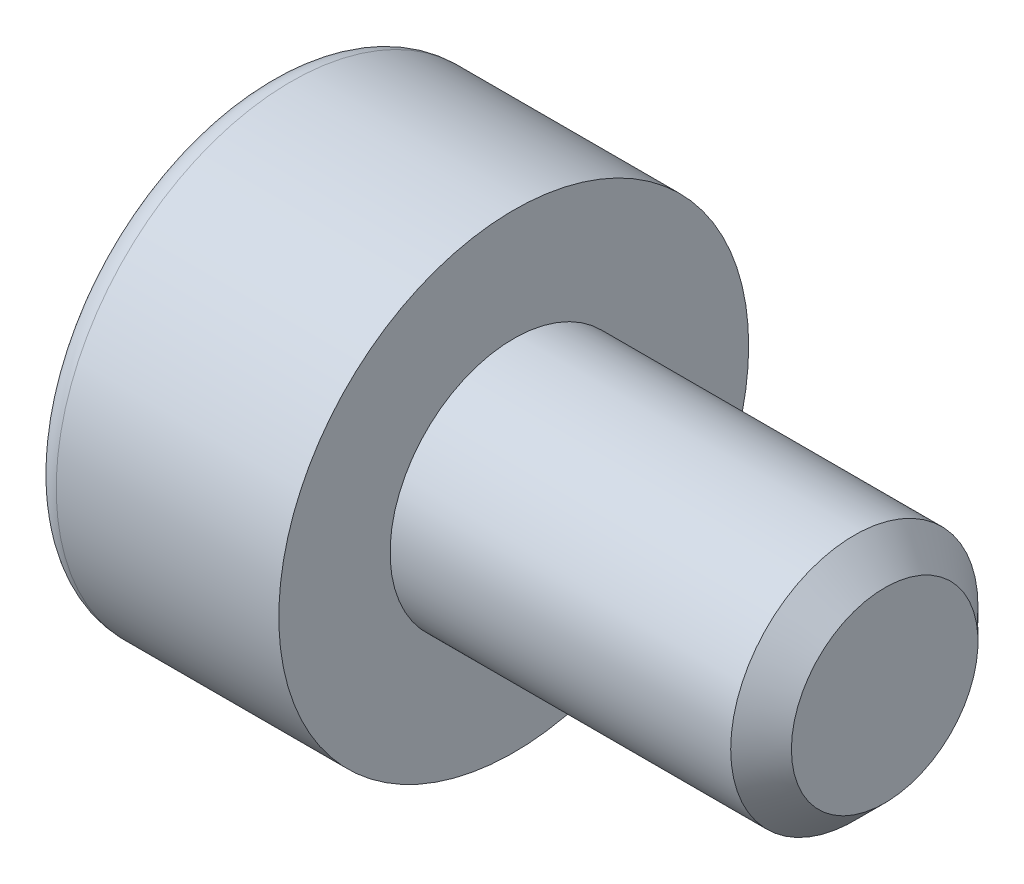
ISO-10303-21;
HEADER;
FILE_DESCRIPTION(('STEP AP214'),'2;1');
FILE_NAME('part.step','',(''),(''),'','','');
FILE_SCHEMA(('AUTOMOTIVE_DESIGN { 1 0 10303 214 1 1 1 1 }'));
ENDSEC;
DATA;
#1=APPLICATION_CONTEXT('core data for automotive mechanical design processes');
#2=APPLICATION_PROTOCOL_DEFINITION('international standard','automotive_design',2000,#1);
#3=PRODUCT_CONTEXT('',#1,'mechanical');
#4=PRODUCT('Part','Part','',(#3));
#5=PRODUCT_RELATED_PRODUCT_CATEGORY('part','',(#4));
#6=PRODUCT_DEFINITION_FORMATION('','',#4);
#7=PRODUCT_DEFINITION_CONTEXT('part definition',#1,'design');
#8=PRODUCT_DEFINITION('design','',#6,#7);
#9=PRODUCT_DEFINITION_SHAPE('','',#8);
#10=(LENGTH_UNIT() NAMED_UNIT(*) SI_UNIT(.MILLI.,.METRE.));
#11=(NAMED_UNIT(*) PLANE_ANGLE_UNIT() SI_UNIT($,.RADIAN.));
#12=(NAMED_UNIT(*) SI_UNIT($,.STERADIAN.) SOLID_ANGLE_UNIT());
#13=UNCERTAINTY_MEASURE_WITH_UNIT(LENGTH_MEASURE(1.E-05),#10,'distance_accuracy_value','');
#14=(GEOMETRIC_REPRESENTATION_CONTEXT(3) GLOBAL_UNCERTAINTY_ASSIGNED_CONTEXT((#13)) GLOBAL_UNIT_ASSIGNED_CONTEXT((#10,
#11,#12)) REPRESENTATION_CONTEXT('',''));
#15=CARTESIAN_POINT('',(0.,0.,0.));
#16=DIRECTION('',(0.,0.,1.));
#17=DIRECTION('',(1.,0.,0.));
#18=AXIS2_PLACEMENT_3D('',#15,#16,#17);
#19=CARTESIAN_POINT('',(-0.549999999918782,0.,0.));
#20=DIRECTION('',(-1.,0.,0.));
#21=DIRECTION('',(0.,0.,1.));
#22=AXIS2_PLACEMENT_3D('',#19,#20,#21);
#23=CONICAL_SURFACE('',#22,0.714285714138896,1.04719755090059);
#24=CARTESIAN_POINT('',(-0.137606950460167,0.,-2.84217094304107E-11));
#25=VERTEX_POINT('',#24);
#26=VERTEX_LOOP('',#25);
#27=FACE_BOUND('',#26,.T.);
#28=CARTESIAN_POINT('',(-0.549999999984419,0.,0.));
#29=DIRECTION('',(-1.,0.,0.));
#30=DIRECTION('',(0.,0.,1.));
#31=AXIS2_PLACEMENT_3D('',#28,#29,#30);
#32=CIRCLE('',#31,0.714285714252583);
#33=CARTESIAN_POINT('',(-0.549999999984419,0.,0.714285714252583));
#34=VERTEX_POINT('',#33);
#35=EDGE_CURVE('E271',#34,#34,#32,.T.);
#36=ORIENTED_EDGE('',*,*,#35,.T.);
#37=EDGE_LOOP('',(#36));
#38=FACE_BOUND('',#37,.T.);
#39=ADVANCED_FACE('F17',(#27,#38),#23,.F.);
#40=CARTESIAN_POINT('',(-0.55,0.430125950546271,0.745));
#41=DIRECTION('',(0.,0.,1.));
#42=DIRECTION('',(1.,0.,0.));
#43=AXIS2_PLACEMENT_3D('',#40,#41,#42);
#44=PLANE('',#43);
#45=DIRECTION('',(0.,1.,0.));
#46=VECTOR('',#45,1.);
#47=CARTESIAN_POINT('',(-0.55,0.,0.745));
#48=LINE('',#47,#46);
#49=CARTESIAN_POINT('',(-0.55,0.430125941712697,0.745000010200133));
#50=VERTEX_POINT('',#49);
#51=CARTESIAN_POINT('',(-0.55,-0.430125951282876,0.744999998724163));
#52=VERTEX_POINT('',#51);
#53=EDGE_CURVE('E79',#50,#52,#48,.F.);
#54=ORIENTED_EDGE('',*,*,#53,.T.);
#55=DIRECTION('',(1.,0.,0.));
#56=VECTOR('',#55,1.);
#57=CARTESIAN_POINT('',(-0.55,-0.430125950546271,0.745));
#58=LINE('',#57,#56);
#59=CARTESIAN_POINT('',(-1.99525190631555,-0.430125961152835,0.745));
#60=VERTEX_POINT('',#59);
#61=EDGE_CURVE('E77',#52,#60,#58,.F.);
#62=ORIENTED_EDGE('',*,*,#61,.T.);
#63=CARTESIAN_POINT('',(-1.99525188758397,0.430125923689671,0.745));
#64=CARTESIAN_POINT('',(-1.98057857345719,0.400751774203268,0.745000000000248));
#65=CARTESIAN_POINT('',(-1.96676197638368,0.370889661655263,0.745000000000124));
#66=CARTESIAN_POINT('',(-1.94143587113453,0.309986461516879,0.744999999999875));
#67=CARTESIAN_POINT('',(-1.92994172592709,0.278939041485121,0.744999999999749));
#68=CARTESIAN_POINT('',(-1.91009392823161,0.215946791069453,0.74500000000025));
#69=CARTESIAN_POINT('',(-1.90172964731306,0.184005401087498,0.745000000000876));
#70=CARTESIAN_POINT('',(-1.888852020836,0.119422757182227,0.744999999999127));
#71=CARTESIAN_POINT('',(-1.88432676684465,0.0867839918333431,0.744999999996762));
#72=CARTESIAN_POINT('',(-1.88130477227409,0.0450212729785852,0.745000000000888));
#73=CARTESIAN_POINT('',(-1.88081631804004,0.0360213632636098,0.745000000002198));
#74=CARTESIAN_POINT('',(-1.88016321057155,0.0180152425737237,0.744999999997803));
#75=CARTESIAN_POINT('',(-1.87999838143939,0.00900903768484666,0.744999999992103));
#76=CARTESIAN_POINT('',(-1.88000811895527,-0.0451932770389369,0.744999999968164));
#77=CARTESIAN_POINT('',(-1.88420483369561,-0.0904578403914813,0.744999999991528));
#78=CARTESIAN_POINT('',(-1.90010453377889,-0.179788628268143,0.745000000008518));
#79=CARTESIAN_POINT('',(-1.91184842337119,-0.223846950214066,0.745000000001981));
#80=CARTESIAN_POINT('',(-1.93586010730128,-0.295054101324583,0.744999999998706));
#81=CARTESIAN_POINT('',(-1.94653452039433,-0.322769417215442,0.744999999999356));
#82=CARTESIAN_POINT('',(-1.96966958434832,-0.377150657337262,0.745000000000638));
#83=CARTESIAN_POINT('',(-1.9821130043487,-0.403823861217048,0.745000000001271));
#84=CARTESIAN_POINT('',(-1.99525191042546,-0.43012596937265,0.745));
#85=B_SPLINE_CURVE_WITH_KNOTS('',3,(#63,#64,#65,#66,#67,#68,#69,#70,#71,#72,#73,#74,#75,#76,#77,
#78,#79,#80,#81,#82,#83,#84),.UNSPECIFIED.,.F.,.F.,(4,2,2,2,2,2,2,2,2,2,4),(0.,
0.0985733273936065,0.19777878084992,0.296644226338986,0.395201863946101,0.422236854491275,
0.449257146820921,0.584802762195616,0.721089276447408,0.810123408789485,0.898343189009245),.UNSPECIFIED.);
#86=CARTESIAN_POINT('',(-1.99525189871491,0.430125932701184,0.7450000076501));
#87=VERTEX_POINT('',#86);
#88=EDGE_CURVE('E22',#87,#60,#85,.T.);
#89=ORIENTED_EDGE('',*,*,#88,.F.);
#90=DIRECTION('',(1.,0.,0.));
#91=VECTOR('',#90,1.);
#92=CARTESIAN_POINT('',(-0.55,0.430125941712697,0.745000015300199));
#93=LINE('',#92,#91);
#94=EDGE_CURVE('E74',#87,#50,#93,.T.);
#95=ORIENTED_EDGE('',*,*,#94,.T.);
#96=EDGE_LOOP('',(#54,#62,#89,#95));
#97=FACE_BOUND('',#96,.T.);
#98=ADVANCED_FACE('F72',(#97),#44,.F.);
#99=CARTESIAN_POINT('',(-0.55,0.,0.));
#100=DIRECTION('',(1.,0.,0.));
#101=DIRECTION('',(0.,0.,-1.));
#102=AXIS2_PLACEMENT_3D('',#99,#100,#101);
#103=PLANE('',#102);
#104=ORIENTED_EDGE('',*,*,#35,.F.);
#105=EDGE_LOOP('',(#104));
#106=FACE_BOUND('',#105,.T.);
#107=DIRECTION('',(0.,0.5,0.866025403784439));
#108=VECTOR('',#107,1.);
#109=CARTESIAN_POINT('',(-0.55,0.430125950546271,-0.745));
#110=LINE('',#109,#108);
#111=CARTESIAN_POINT('',(-0.55,0.860251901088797,-6.48721083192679E-12));
#112=VERTEX_POINT('',#111);
#113=CARTESIAN_POINT('',(-0.55,0.430125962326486,-0.745));
#114=VERTEX_POINT('',#113);
#115=EDGE_CURVE('E302',#112,#114,#110,.F.);
#116=ORIENTED_EDGE('',*,*,#115,.T.);
#117=DIRECTION('',(0.,1.,0.));
#118=VECTOR('',#117,1.);
#119=CARTESIAN_POINT('',(-0.55,-0.430125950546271,-0.745));
#120=LINE('',#119,#118);
#121=CARTESIAN_POINT('',(-0.55,-0.430125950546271,-0.745));
#122=VERTEX_POINT('',#121);
#123=EDGE_CURVE('E308',#114,#122,#120,.F.);
#124=ORIENTED_EDGE('',*,*,#123,.T.);
#125=DIRECTION('',(0.,0.5,-0.866025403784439));
#126=VECTOR('',#125,1.);
#127=CARTESIAN_POINT('',(-0.55,-0.860251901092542,0.));
#128=LINE('',#127,#126);
#129=CARTESIAN_POINT('',(-0.55,-0.860251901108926,-2.83778580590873E-11));
#130=VERTEX_POINT('',#129);
#131=EDGE_CURVE('E272',#122,#130,#128,.F.);
#132=ORIENTED_EDGE('',*,*,#131,.T.);
#133=DIRECTION('',(0.,-0.5,-0.866025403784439));
#134=VECTOR('',#133,1.);
#135=CARTESIAN_POINT('',(-0.55,-0.430125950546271,0.745));
#136=LINE('',#135,#134);
#137=EDGE_CURVE('E284',#130,#52,#136,.F.);
#138=ORIENTED_EDGE('',*,*,#137,.T.);
#139=ORIENTED_EDGE('',*,*,#53,.F.);
#140=DIRECTION('',(0.,-0.5,0.866025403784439));
#141=VECTOR('',#140,1.);
#142=CARTESIAN_POINT('',(-0.55,0.860251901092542,0.));
#143=LINE('',#142,#141);
#144=EDGE_CURVE('E87',#50,#112,#143,.F.);
#145=ORIENTED_EDGE('',*,*,#144,.T.);
#146=EDGE_LOOP('',(#116,#124,#132,#138,#139,#145));
#147=FACE_BOUND('',#146,.T.);
#148=ADVANCED_FACE('F240',(#106,#147),#103,.F.);
#149=CARTESIAN_POINT('',(-0.55,-0.860251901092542,0.));
#150=DIRECTION('',(0.,-0.866025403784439,-0.5));
#151=DIRECTION('',(0.,0.5,-0.866025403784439));
#152=AXIS2_PLACEMENT_3D('',#149,#150,#151);
#153=PLANE('',#152);
#154=ORIENTED_EDGE('',*,*,#131,.F.);
#155=DIRECTION('',(-1.,0.,0.));
#156=VECTOR('',#155,1.);
#157=CARTESIAN_POINT('',(-0.55,-0.430125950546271,-0.745));
#158=LINE('',#157,#156);
#159=CARTESIAN_POINT('',(-1.99525189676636,-0.430125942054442,-0.745));
#160=VERTEX_POINT('',#159);
#161=EDGE_CURVE('E305',#122,#160,#158,.T.);
#162=ORIENTED_EDGE('',*,*,#161,.T.);
#163=CARTESIAN_POINT('',(-1.9952518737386,-0.430125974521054,-0.744999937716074));
#164=CARTESIAN_POINT('',(-1.98048247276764,-0.444909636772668,-0.719393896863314));
#165=CARTESIAN_POINT('',(-1.96658057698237,-0.459940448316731,-0.693359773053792));
#166=CARTESIAN_POINT('',(-1.94112679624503,-0.490589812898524,-0.640273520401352));
#167=CARTESIAN_POINT('',(-1.92958906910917,-0.506211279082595,-0.613216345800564));
#168=CARTESIAN_POINT('',(-1.90982500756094,-0.537711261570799,-0.558656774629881));
#169=CARTESIAN_POINT('',(-1.90154900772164,-0.55358175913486,-0.531168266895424));
#170=CARTESIAN_POINT('',(-1.88879772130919,-0.585671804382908,-0.475586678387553));
#171=CARTESIAN_POINT('',(-1.88431292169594,-0.601890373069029,-0.44749529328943));
#172=CARTESIAN_POINT('',(-1.88026776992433,-0.629845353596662,-0.399075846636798));
#173=CARTESIAN_POINT('',(-1.87967004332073,-0.641545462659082,-0.378810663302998));
#174=CARTESIAN_POINT('',(-1.88067744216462,-0.664922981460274,-0.338319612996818));
#175=CARTESIAN_POINT('',(-1.8822830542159,-0.676600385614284,-0.318093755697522));
#176=CARTESIAN_POINT('',(-1.89029877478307,-0.711465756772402,-0.257705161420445));
#177=CARTESIAN_POINT('',(-1.89990867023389,-0.734480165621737,-0.217843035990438));
#178=CARTESIAN_POINT('',(-1.92308946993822,-0.77485586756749,-0.147910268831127));
#179=CARTESIAN_POINT('',(-1.93544104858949,-0.792407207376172,-0.117510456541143));
#180=CARTESIAN_POINT('',(-1.96326253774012,-0.826823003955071,-0.0579005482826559));
#181=CARTESIAN_POINT('',(-1.9787222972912,-0.843689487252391,-0.0286869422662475));
#182=CARTESIAN_POINT('',(-1.99525186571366,-0.860251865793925,-6.11389985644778E-08));
#183=B_SPLINE_CURVE_WITH_KNOTS('',3,(#163,#164,#165,#166,#167,#168,#169,#170,#171,#172,#173,
#174,#175,#176,#177,#178,#179,#180,#181,#182),.UNSPECIFIED.,.F.,.F.,(4,2,2,2,2,2,2,2,2,4),(0.,
0.0992212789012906,0.199020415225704,0.29723507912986,0.395202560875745,0.465324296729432,
0.535461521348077,0.675775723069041,0.787264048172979,0.898394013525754),.UNSPECIFIED.);
#184=CARTESIAN_POINT('',(-1.99525188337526,-0.860251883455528,-3.05907716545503E-08));
#185=VERTEX_POINT('',#184);
#186=EDGE_CURVE('E98',#160,#185,#183,.T.);
#187=ORIENTED_EDGE('',*,*,#186,.T.);
#188=DIRECTION('',(1.,0.,0.));
#189=VECTOR('',#188,1.);
#190=CARTESIAN_POINT('',(-0.55,-0.860251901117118,-4.25666446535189E-11));
#191=LINE('',#190,#189);
#192=EDGE_CURVE('E274',#185,#130,#191,.T.);
#193=ORIENTED_EDGE('',*,*,#192,.T.);
#194=EDGE_LOOP('',(#154,#162,#187,#193));
#195=FACE_BOUND('',#194,.T.);
#196=ADVANCED_FACE('F233',(#195),#153,.F.);
#197=CARTESIAN_POINT('',(-0.55,-0.430125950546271,0.745));
#198=DIRECTION('',(0.,-0.866025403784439,0.5));
#199=DIRECTION('',(0.,-0.5,-0.866025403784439));
#200=AXIS2_PLACEMENT_3D('',#197,#198,#199);
#201=PLANE('',#200);
#202=ORIENTED_EDGE('',*,*,#137,.F.);
#203=ORIENTED_EDGE('',*,*,#192,.F.);
#204=CARTESIAN_POINT('',(-1.99525190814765,-0.860251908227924,-1.23588435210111E-08));
#205=CARTESIAN_POINT('',(-1.98048250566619,-0.845468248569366,0.025606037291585));
#206=CARTESIAN_POINT('',(-1.96658060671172,-0.830437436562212,0.0516401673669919));
#207=CARTESIAN_POINT('',(-1.94112681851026,-0.799788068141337,0.104726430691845));
#208=CARTESIAN_POINT('',(-1.92958908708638,-0.784166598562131,0.131783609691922));
#209=CARTESIAN_POINT('',(-1.90982501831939,-0.752666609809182,0.186343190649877));
#210=CARTESIAN_POINT('',(-1.90154901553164,-0.736796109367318,0.213831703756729));
#211=CARTESIAN_POINT('',(-1.88879772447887,-0.704706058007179,0.269413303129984));
#212=CARTESIAN_POINT('',(-1.88431292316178,-0.688487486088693,0.297504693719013));
#213=CARTESIAN_POINT('',(-1.88026777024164,-0.660532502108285,0.345924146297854));
#214=CARTESIAN_POINT('',(-1.87967004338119,-0.64883239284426,0.366189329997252));
#215=CARTESIAN_POINT('',(-1.88067744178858,-0.625454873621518,0.406680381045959));
#216=CARTESIAN_POINT('',(-1.88228305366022,-0.613777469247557,0.426906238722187));
#217=CARTESIAN_POINT('',(-1.89029877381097,-0.57891209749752,0.487294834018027));
#218=CARTESIAN_POINT('',(-1.89990866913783,-0.555897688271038,0.527156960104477));
#219=CARTESIAN_POINT('',(-1.92308946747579,-0.515521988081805,0.597089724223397));
#220=CARTESIAN_POINT('',(-1.93544104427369,-0.497970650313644,0.627489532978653));
#221=CARTESIAN_POINT('',(-1.96326252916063,-0.46355485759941,0.687099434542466));
#222=CARTESIAN_POINT('',(-1.97872228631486,-0.446688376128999,0.716313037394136));
#223=CARTESIAN_POINT('',(-1.99525185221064,-0.430125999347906,0.744999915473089));
#224=B_SPLINE_CURVE_WITH_KNOTS('',3,(#204,#205,#206,#207,#208,#209,#210,#211,#212,#213,#214,
#215,#216,#217,#218,#219,#220,#221,#222,#223),.UNSPECIFIED.,.F.,.F.,(4,2,2,2,2,2,2,2,2,4),(0.,
0.0992212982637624,0.199020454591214,0.297235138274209,0.395202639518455,0.465324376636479,
0.535461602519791,0.675775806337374,0.787264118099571,0.898394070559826),.UNSPECIFIED.);
#225=EDGE_CURVE('E94',#185,#60,#224,.T.);
#226=ORIENTED_EDGE('',*,*,#225,.T.);
#227=ORIENTED_EDGE('',*,*,#61,.F.);
#228=EDGE_LOOP('',(#202,#203,#226,#227));
#229=FACE_BOUND('',#228,.T.);
#230=ADVANCED_FACE('F151',(#229),#201,.F.);
#231=CARTESIAN_POINT('',(-0.55,0.860251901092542,0.));
#232=DIRECTION('',(0.,0.866025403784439,0.5));
#233=DIRECTION('',(0.,-0.5,0.866025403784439));
#234=AXIS2_PLACEMENT_3D('',#231,#232,#233);
#235=PLANE('',#234);
#236=ORIENTED_EDGE('',*,*,#144,.F.);
#237=ORIENTED_EDGE('',*,*,#94,.F.);
#238=CARTESIAN_POINT('',(-1.99525190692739,0.430125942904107,0.745000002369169));
#239=CARTESIAN_POINT('',(-1.98048250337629,0.444909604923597,0.71939395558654));
#240=CARTESIAN_POINT('',(-1.96658060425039,0.459940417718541,0.693359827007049));
#241=CARTESIAN_POINT('',(-1.94112681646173,0.490589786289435,0.640273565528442));
#242=CARTESIAN_POINT('',(-1.92958908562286,0.506211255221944,0.61321638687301));
#243=CARTESIAN_POINT('',(-1.90982501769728,0.53771124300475,0.558656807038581));
#244=CARTESIAN_POINT('',(-1.90154901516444,0.55358174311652,0.53116829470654));
#245=CARTESIAN_POINT('',(-1.88879772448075,0.585671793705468,0.475586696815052));
#246=CARTESIAN_POINT('',(-1.88431292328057,0.601890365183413,0.447495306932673));
#247=CARTESIAN_POINT('',(-1.88026777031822,0.629845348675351,0.399075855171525));
#248=CARTESIAN_POINT('',(-1.87967004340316,0.641545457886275,0.378810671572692));
#249=CARTESIAN_POINT('',(-1.8806774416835,0.664922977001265,0.338319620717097));
#250=CARTESIAN_POINT('',(-1.88228305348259,0.676600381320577,0.318093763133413));
#251=CARTESIAN_POINT('',(-1.89029877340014,0.711465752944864,0.25770516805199));
#252=CARTESIAN_POINT('',(-1.89990866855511,0.734480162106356,0.217843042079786));
#253=CARTESIAN_POINT('',(-1.92308946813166,0.774855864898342,0.147910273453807));
#254=CARTESIAN_POINT('',(-1.93544104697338,0.792407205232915,0.117510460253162));
#255=CARTESIAN_POINT('',(-1.96326253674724,0.826823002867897,0.0579005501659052));
#256=CARTESIAN_POINT('',(-1.9787222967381,0.843689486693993,0.0286869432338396));
#257=CARTESIAN_POINT('',(-1.99525186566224,0.860251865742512,6.12280482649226E-08));
#258=B_SPLINE_CURVE_WITH_KNOTS('',3,(#238,#239,#240,#241,#242,#243,#244,#245,#246,#247,#248,
#249,#250,#251,#252,#253,#254,#255,#256,#257),.UNSPECIFIED.,.F.,.F.,(4,2,2,2,2,2,2,2,2,4),(0.,
0.0992212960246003,0.199020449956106,0.297235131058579,0.39520262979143,0.465324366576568,
0.535461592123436,0.675775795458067,0.787264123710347,0.89839409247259),.UNSPECIFIED.);
#259=CARTESIAN_POINT('',(-1.99525188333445,0.860251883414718,3.06091587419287E-08));
#260=VERTEX_POINT('',#259);
#261=EDGE_CURVE('E84',#87,#260,#258,.T.);
#262=ORIENTED_EDGE('',*,*,#261,.T.);
#263=DIRECTION('',(1.,0.,0.));
#264=VECTOR('',#263,1.);
#265=CARTESIAN_POINT('',(-0.55,0.860251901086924,-9.73082291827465E-12));
#266=LINE('',#265,#264);
#267=EDGE_CURVE('E300',#260,#112,#266,.T.);
#268=ORIENTED_EDGE('',*,*,#267,.T.);
#269=EDGE_LOOP('',(#236,#237,#262,#268));
#270=FACE_BOUND('',#269,.T.);
#271=ADVANCED_FACE('F82',(#270),#235,.F.);
#272=CARTESIAN_POINT('',(-0.55,0.430125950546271,-0.745));
#273=DIRECTION('',(0.,0.866025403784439,-0.5));
#274=DIRECTION('',(0.,0.5,0.866025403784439));
#275=AXIS2_PLACEMENT_3D('',#272,#273,#274);
#276=PLANE('',#275);
#277=ORIENTED_EDGE('',*,*,#115,.F.);
#278=ORIENTED_EDGE('',*,*,#267,.F.);
#279=CARTESIAN_POINT('',(-1.99525190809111,0.860251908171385,1.22609160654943E-08));
#280=CARTESIAN_POINT('',(-1.98048250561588,0.845468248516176,-0.0256060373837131));
#281=CARTESIAN_POINT('',(-1.96658060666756,0.830437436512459,-0.0516401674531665));
#282=CARTESIAN_POINT('',(-1.94112681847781,0.799788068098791,-0.104726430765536));
#283=CARTESIAN_POINT('',(-1.92958908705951,0.784166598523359,-0.131783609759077));
#284=CARTESIAN_POINT('',(-1.90982501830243,0.752666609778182,-0.18634319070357));
#285=CARTESIAN_POINT('',(-1.90154901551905,0.73679610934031,-0.213831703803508));
#286=CARTESIAN_POINT('',(-1.88879772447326,0.704706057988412,-0.26941330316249));
#287=CARTESIAN_POINT('',(-1.88431292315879,0.688487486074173,-0.297504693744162));
#288=CARTESIAN_POINT('',(-1.88026777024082,0.660532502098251,-0.345924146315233));
#289=CARTESIAN_POINT('',(-1.87967004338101,0.648832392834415,-0.366189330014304));
#290=CARTESIAN_POINT('',(-1.88067744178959,0.625454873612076,-0.406680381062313));
#291=CARTESIAN_POINT('',(-1.88228305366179,0.613777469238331,-0.426906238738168));
#292=CARTESIAN_POINT('',(-1.89029877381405,0.578912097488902,-0.487294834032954));
#293=CARTESIAN_POINT('',(-1.89990866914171,0.555897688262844,-0.527156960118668));
#294=CARTESIAN_POINT('',(-1.92308946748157,0.515521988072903,-0.597089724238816));
#295=CARTESIAN_POINT('',(-1.93544104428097,0.497970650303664,-0.627489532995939));
#296=CARTESIAN_POINT('',(-1.9632625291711,0.463554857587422,-0.68709943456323));
#297=CARTESIAN_POINT('',(-1.97872228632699,0.446688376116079,-0.716313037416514));
#298=CARTESIAN_POINT('',(-1.99525185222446,0.430125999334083,-0.744999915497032));
#299=B_SPLINE_CURVE_WITH_KNOTS('',3,(#279,#280,#281,#282,#283,#284,#285,#286,#287,#288,#289,
#290,#291,#292,#293,#294,#295,#296,#297,#298),.UNSPECIFIED.,.F.,.F.,(4,2,2,2,2,2,2,2,2,4),(0.,
0.0992212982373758,0.199020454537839,0.297235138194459,0.395202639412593,0.465324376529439,
0.535461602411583,0.675775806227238,0.787264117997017,0.898394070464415),.UNSPECIFIED.);
#300=CARTESIAN_POINT('',(-1.99525188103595,0.430125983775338,-0.744999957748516));
#301=VERTEX_POINT('',#300);
#302=EDGE_CURVE('E93',#260,#301,#299,.T.);
#303=ORIENTED_EDGE('',*,*,#302,.T.);
#304=DIRECTION('',(-1.,0.,0.));
#305=VECTOR('',#304,1.);
#306=CARTESIAN_POINT('',(-0.55,0.430125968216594,-0.745));
#307=LINE('',#306,#305);
#308=EDGE_CURVE('E311',#301,#114,#307,.F.);
#309=ORIENTED_EDGE('',*,*,#308,.T.);
#310=EDGE_LOOP('',(#277,#278,#303,#309));
#311=FACE_BOUND('',#310,.T.);
#312=ADVANCED_FACE('F141',(#311),#276,.F.);
#313=CARTESIAN_POINT('',(-0.55,-0.430125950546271,-0.745));
#314=DIRECTION('',(0.,0.,-1.));
#315=DIRECTION('',(-1.,0.,0.));
#316=AXIS2_PLACEMENT_3D('',#313,#314,#315);
#317=PLANE('',#316);
#318=ORIENTED_EDGE('',*,*,#123,.F.);
#319=ORIENTED_EDGE('',*,*,#308,.F.);
#320=CARTESIAN_POINT('',(-1.99525192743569,0.430125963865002,-0.744999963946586));
#321=CARTESIAN_POINT('',(-1.98057860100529,0.400751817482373,-0.744999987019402));
#322=CARTESIAN_POINT('',(-1.96676199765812,0.37088970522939,-0.744999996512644));
#323=CARTESIAN_POINT('',(-1.94143588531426,0.309986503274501,-0.74500000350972));
#324=CARTESIAN_POINT('',(-1.92994173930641,0.278939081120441,-0.745000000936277));
#325=CARTESIAN_POINT('',(-1.91009393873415,0.215946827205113,-0.744999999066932));
#326=CARTESIAN_POINT('',(-1.90172965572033,0.184005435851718,-0.744999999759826));
#327=CARTESIAN_POINT('',(-1.8888520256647,0.11942278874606,-0.745000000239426));
#328=CARTESIAN_POINT('',(-1.88432677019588,0.0867840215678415,-0.745000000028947));
#329=CARTESIAN_POINT('',(-1.88130477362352,0.0450212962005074,-0.74499999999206));
#330=CARTESIAN_POINT('',(-1.88081631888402,0.0360213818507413,-0.744999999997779));
#331=CARTESIAN_POINT('',(-1.88016321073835,0.0180152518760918,-0.74500000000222));
#332=CARTESIAN_POINT('',(-1.87999838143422,0.00900904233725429,-0.745000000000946));
#333=CARTESIAN_POINT('',(-1.88000811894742,-0.0451932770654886,-0.744999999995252));
#334=CARTESIAN_POINT('',(-1.88420483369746,-0.0904578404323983,-0.744999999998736));
#335=CARTESIAN_POINT('',(-1.90010453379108,-0.179788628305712,-0.74500000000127));
#336=CARTESIAN_POINT('',(-1.91184842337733,-0.223846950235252,-0.745000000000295));
#337=CARTESIAN_POINT('',(-1.93586010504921,-0.295054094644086,-0.744999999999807));
#338=CARTESIAN_POINT('',(-1.94653451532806,-0.322769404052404,-0.744999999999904));
#339=CARTESIAN_POINT('',(-1.9696695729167,-0.377150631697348,-0.745000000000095));
#340=CARTESIAN_POINT('',(-1.98211298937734,-0.403823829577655,-0.74500000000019));
#341=CARTESIAN_POINT('',(-1.99525189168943,-0.430125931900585,-0.745));
#342=B_SPLINE_CURVE_WITH_KNOTS('',3,(#320,#321,#322,#323,#324,#325,#326,#327,#328,#329,#330,
#331,#332,#333,#334,#335,#336,#337,#338,#339,#340,#341),.UNSPECIFIED.,.F.,.F.,(4,2,2,2,2,2,2,2,
2,2,4),(0.,0.098573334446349,0.197778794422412,0.296644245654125,0.395201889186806,
0.422236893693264,0.449257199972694,0.584802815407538,0.721089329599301,0.810123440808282,
0.898343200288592),.UNSPECIFIED.);
#343=EDGE_CURVE('E96',#301,#160,#342,.T.);
#344=ORIENTED_EDGE('',*,*,#343,.T.);
#345=ORIENTED_EDGE('',*,*,#161,.F.);
#346=EDGE_LOOP('',(#318,#319,#344,#345));
#347=FACE_BOUND('',#346,.T.);
#348=ADVANCED_FACE('F138',(#347),#317,.F.);
#349=CARTESIAN_POINT('',(3.,0.37725,0.));
#350=DIRECTION('',(1.,0.,0.));
#351=DIRECTION('',(0.,0.,-1.));
#352=AXIS2_PLACEMENT_3D('',#349,#350,#351);
#353=PLANE('',#352);
#354=CARTESIAN_POINT('',(2.9999999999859,0.,0.));
#355=DIRECTION('',(-1.,0.,0.));
#356=DIRECTION('',(0.,0.,1.));
#357=AXIS2_PLACEMENT_3D('',#354,#355,#356);
#358=CIRCLE('',#357,0.754499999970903);
#359=CARTESIAN_POINT('',(2.9999999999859,0.,0.754499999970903));
#360=VERTEX_POINT('',#359);
#361=EDGE_CURVE('E136',#360,#360,#358,.T.);
#362=ORIENTED_EDGE('',*,*,#361,.F.);
#363=EDGE_LOOP('',(#362));
#364=FACE_BOUND('',#363,.T.);
#365=ADVANCED_FACE('F120',(#364),#353,.T.);
#366=CARTESIAN_POINT('',(-1.99999999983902,0.,0.));
#367=DIRECTION('',(-1.,0.,0.));
#368=DIRECTION('',(0.,0.,1.));
#369=AXIS2_PLACEMENT_3D('',#366,#367,#368);
#370=CONICAL_SURFACE('',#369,0.864999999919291,0.785398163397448);
#371=ORIENTED_EDGE('',*,*,#261,.F.);
#372=ORIENTED_EDGE('',*,*,#88,.T.);
#373=ORIENTED_EDGE('',*,*,#225,.F.);
#374=ORIENTED_EDGE('',*,*,#186,.F.);
#375=ORIENTED_EDGE('',*,*,#343,.F.);
#376=ORIENTED_EDGE('',*,*,#302,.F.);
#377=EDGE_LOOP('',(#371,#372,#373,#374,#375,#376));
#378=FACE_BOUND('',#377,.T.);
#379=CARTESIAN_POINT('',(-1.99999999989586,0.,0.));
#380=DIRECTION('',(-1.,0.,0.));
#381=DIRECTION('',(0.,0.,1.));
#382=AXIS2_PLACEMENT_3D('',#379,#380,#381);
#383=CIRCLE('',#382,0.864999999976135);
#384=CARTESIAN_POINT('',(-1.99999999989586,0.,0.864999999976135));
#385=VERTEX_POINT('',#384);
#386=EDGE_CURVE('E178',#385,#385,#383,.F.);
#387=ORIENTED_EDGE('',*,*,#386,.F.);
#388=EDGE_LOOP('',(#387));
#389=FACE_BOUND('',#388,.T.);
#390=ADVANCED_FACE('F90',(#378,#389),#370,.F.);
#391=CARTESIAN_POINT('',(2.75450000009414,0.,0.));
#392=DIRECTION('',(-1.,0.,0.));
#393=DIRECTION('',(0.,0.,1.));
#394=AXIS2_PLACEMENT_3D('',#391,#392,#393);
#395=CONICAL_SURFACE('',#394,0.999999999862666,0.785398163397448);
#396=CARTESIAN_POINT('',(2.7545,0.,0.));
#397=DIRECTION('',(1.,0.,0.));
#398=DIRECTION('',(0.,0.,-1.));
#399=AXIS2_PLACEMENT_3D('',#396,#397,#398);
#400=CIRCLE('',#399,1.);
#401=CARTESIAN_POINT('',(2.7545,0.,-1.));
#402=VERTEX_POINT('',#401);
#403=EDGE_CURVE('E187',#402,#402,#400,.F.);
#404=ORIENTED_EDGE('',*,*,#403,.F.);
#405=EDGE_LOOP('',(#404));
#406=FACE_BOUND('',#405,.T.);
#407=ORIENTED_EDGE('',*,*,#361,.T.);
#408=EDGE_LOOP('',(#407));
#409=FACE_BOUND('',#408,.T.);
#410=ADVANCED_FACE('F119',(#406,#409),#395,.T.);
#411=CARTESIAN_POINT('',(-2.,1.2825,0.));
#412=DIRECTION('',(-1.,0.,0.));
#413=DIRECTION('',(0.,0.,1.));
#414=AXIS2_PLACEMENT_3D('',#411,#412,#413);
#415=PLANE('',#414);
#416=ORIENTED_EDGE('',*,*,#386,.T.);
#417=EDGE_LOOP('',(#416));
#418=FACE_BOUND('',#417,.T.);
#419=CARTESIAN_POINT('',(-2.00000000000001,1.7,0.));
#420=CARTESIAN_POINT('',(-1.99999997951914,1.70000245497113,0.0305664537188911));
#421=CARTESIAN_POINT('',(-1.99999999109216,1.69917412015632,0.0611268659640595));
#422=CARTESIAN_POINT('',(-2.00000000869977,1.6958948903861,0.122160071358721));
#423=CARTESIAN_POINT('',(-2.00000001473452,1.69344403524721,0.152632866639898));
#424=CARTESIAN_POINT('',(-1.99999994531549,1.68631037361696,0.219494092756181));
#425=CARTESIAN_POINT('',(-1.99999985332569,1.68127925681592,0.255846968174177));
#426=CARTESIAN_POINT('',(-1.99999981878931,1.67340820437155,0.301183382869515));
#427=CARTESIAN_POINT('',(-1.99999981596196,1.6717291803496,0.310375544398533));
#428=CARTESIAN_POINT('',(-1.99999981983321,1.66513061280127,0.344835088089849));
#429=CARTESIAN_POINT('',(-1.99999985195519,1.65969499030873,0.370004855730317));
#430=CARTESIAN_POINT('',(-1.99999992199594,1.64404231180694,0.435266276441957));
#431=CARTESIAN_POINT('',(-1.99999995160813,1.63292512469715,0.475146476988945));
#432=CARTESIAN_POINT('',(-1.99999998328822,1.61401348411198,0.53449232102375));
#433=CARTESIAN_POINT('',(-1.99999999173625,1.60729198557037,0.554307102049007));
#434=CARTESIAN_POINT('',(-1.99999999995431,1.5935542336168,0.592488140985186));
#435=CARTESIAN_POINT('',(-2.00000000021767,1.58658030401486,0.610869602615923));
#436=CARTESIAN_POINT('',(-1.99999999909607,1.56715083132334,0.659552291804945));
#437=CARTESIAN_POINT('',(-1.99999999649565,1.55413951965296,0.68963340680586));
#438=CARTESIAN_POINT('',(-1.99999999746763,1.52642076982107,0.749003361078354));
#439=CARTESIAN_POINT('',(-2.00000000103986,1.51171338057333,0.778292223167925));
#440=CARTESIAN_POINT('',(-1.99999999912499,1.48841868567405,0.821557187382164));
#441=CARTESIAN_POINT('',(-1.99999999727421,1.48044772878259,0.835868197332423));
#442=CARTESIAN_POINT('',(-1.99999998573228,1.46410060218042,0.864257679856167));
#443=CARTESIAN_POINT('',(-1.999999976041,1.45572442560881,0.87833614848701));
#444=CARTESIAN_POINT('',(-1.99999994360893,1.43685682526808,0.90903901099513));
#445=CARTESIAN_POINT('',(-1.99999991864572,1.42627742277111,0.9256093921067));
#446=CARTESIAN_POINT('',(-1.99999982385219,1.40456316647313,0.958383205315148));
#447=CARTESIAN_POINT('',(-1.99999975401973,1.39342828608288,0.974586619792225));
#448=CARTESIAN_POINT('',(-1.99999959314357,1.3666454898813,1.01210764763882));
#449=CARTESIAN_POINT('',(-1.99999950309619,1.35076618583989,1.03326051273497));
#450=CARTESIAN_POINT('',(-1.99999951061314,1.31390000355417,1.0799474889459));
#451=CARTESIAN_POINT('',(-1.99999966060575,1.29262744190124,1.10525758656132));
#452=CARTESIAN_POINT('',(-1.99999989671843,1.25734405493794,1.1446190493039));
#453=CARTESIAN_POINT('',(-1.9999999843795,1.24383374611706,1.15912281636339));
#454=CARTESIAN_POINT('',(-2.00000000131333,1.22689078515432,1.17677832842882));
#455=CARTESIAN_POINT('',(-2.00000000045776,1.22365794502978,1.18012369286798));
#456=CARTESIAN_POINT('',(-1.99999999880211,1.21296499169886,1.19111797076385));
#457=CARTESIAN_POINT('',(-1.99999999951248,1.20545898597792,1.19872249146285));
#458=CARTESIAN_POINT('',(-2.00000000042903,1.18646924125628,1.21760476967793));
#459=CARTESIAN_POINT('',(-2.00000000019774,1.17489591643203,1.22879266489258));
#460=CARTESIAN_POINT('',(-1.9999999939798,1.14749877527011,1.25454690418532));
#461=CARTESIAN_POINT('',(-1.99999998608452,1.131553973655,1.26898463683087));
#462=CARTESIAN_POINT('',(-1.99999994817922,1.09505067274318,1.30080550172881));
#463=CARTESIAN_POINT('',(-1.99999991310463,1.07434077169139,1.31801567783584));
#464=CARTESIAN_POINT('',(-1.9999998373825,1.04044466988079,1.34484655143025));
#465=CARTESIAN_POINT('',(-1.99999980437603,1.02750918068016,1.354785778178));
#466=CARTESIAN_POINT('',(-1.99999974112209,1.00135360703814,1.37428302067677));
#467=CARTESIAN_POINT('',(-1.9999997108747,0.988133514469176,1.38384102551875));
#468=CARTESIAN_POINT('',(-1.99999962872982,0.948064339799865,1.41193217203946));
#469=CARTESIAN_POINT('',(-1.99999958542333,0.920804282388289,1.42988409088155));
#470=CARTESIAN_POINT('',(-1.99999954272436,0.865287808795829,1.46417098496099));
#471=CARTESIAN_POINT('',(-1.999999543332,0.837031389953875,1.48050595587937));
#472=CARTESIAN_POINT('',(-1.99999958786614,0.779616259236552,1.51150343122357));
#473=CARTESIAN_POINT('',(-1.99999963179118,0.750457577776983,1.5261659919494));
#474=CARTESIAN_POINT('',(-1.99999974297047,0.691340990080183,1.55377339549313));
#475=CARTESIAN_POINT('',(-1.99999981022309,0.661383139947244,1.56671835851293));
#476=CARTESIAN_POINT('',(-1.99999993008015,0.60076066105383,1.59082700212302));
#477=CARTESIAN_POINT('',(-1.99999998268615,0.570096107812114,1.60199087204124));
#478=CARTESIAN_POINT('',(-2.00000000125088,0.527144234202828,1.61627407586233));
#479=CARTESIAN_POINT('',(-2.00000000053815,0.515098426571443,1.62013437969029));
#480=CARTESIAN_POINT('',(-1.99999999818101,0.484112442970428,1.6296981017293));
#481=CARTESIAN_POINT('',(-1.9999999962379,0.465113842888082,1.63521373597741));
#482=CARTESIAN_POINT('',(-1.9999999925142,0.420053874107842,1.64745065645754));
#483=CARTESIAN_POINT('',(-1.99999999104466,0.393915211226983,1.65388986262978));
#484=CARTESIAN_POINT('',(-1.99999999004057,0.351892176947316,1.66319489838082));
#485=CARTESIAN_POINT('',(-1.99999998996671,0.336094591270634,1.66645886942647));
#486=CARTESIAN_POINT('',(-1.99999999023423,0.30266179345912,1.67287305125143));
#487=CARTESIAN_POINT('',(-1.99999999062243,0.285016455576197,1.67597081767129));
#488=CARTESIAN_POINT('',(-1.99999999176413,0.247876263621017,1.68188882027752));
#489=CARTESIAN_POINT('',(-1.99999999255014,0.228372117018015,1.68465075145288));
#490=CARTESIAN_POINT('',(-1.99999999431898,0.18751024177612,1.68971557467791));
#491=CARTESIAN_POINT('',(-1.99999999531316,0.166144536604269,1.69195428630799));
#492=CARTESIAN_POINT('',(-1.99999999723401,0.121567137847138,1.69577357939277));
#493=CARTESIAN_POINT('',(-1.99999999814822,0.0983494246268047,1.69728410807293));
#494=CARTESIAN_POINT('',(-1.99999999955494,0.0500901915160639,1.69943156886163));
#495=CARTESIAN_POINT('',(-2.00000000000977,0.0250452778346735,1.69999267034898));
#496=CARTESIAN_POINT('',(-2.00000000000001,0.,1.7));
#497=B_SPLINE_CURVE_WITH_KNOTS('',3,(#419,#420,#421,#422,#423,#424,#425,#426,#427,#428,#429,
#430,#431,#432,#433,#434,#435,#436,#437,#438,#439,#440,#441,#442,#443,#444,#445,#446,#447,#448,
#449,#450,#451,#452,#453,#454,#455,#456,#457,#458,#459,#460,#461,#462,#463,#464,#465,#466,#467,
#468,#469,#470,#471,#472,#473,#474,#475,#476,#477,#478,#479,#480,#481,#482,#483,#484,#485,#486,
#487,#488,#489,#490,#491,#492,#493,#494,#495,#496),.UNSPECIFIED.,.F.,.F.,(4,2,2,2,2,2,2,2,2,2,2,
2,2,2,2,2,2,2,2,2,2,2,2,2,2,2,2,2,2,2,2,2,2,2,2,2,2,2,4),(0.,0.0916770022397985,
0.183351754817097,0.29335810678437,0.321390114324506,0.398614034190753,0.522689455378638,
0.5854490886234,0.644418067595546,0.742686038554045,0.840951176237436,0.890088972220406,
0.939227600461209,0.998194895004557,1.05716501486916,1.1364850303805,1.23560005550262,
1.2950528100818,1.30900934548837,1.34106270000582,1.38934690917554,1.45386279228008,
1.53461196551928,1.58354479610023,1.6324790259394,1.73033954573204,1.82820032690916,
1.9260578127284,2.02390844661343,2.12174867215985,2.15969457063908,2.21903217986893,
2.29975894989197,2.34814723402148,2.40188357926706,2.46096801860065,2.52540061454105,
2.5951814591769,2.67031067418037),.UNSPECIFIED.);
#498=CARTESIAN_POINT('',(-2.00000000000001,1.7,0.));
#499=VERTEX_POINT('',#498);
#500=CARTESIAN_POINT('',(-2.,0.,1.70000000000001));
#501=VERTEX_POINT('',#500);
#502=EDGE_CURVE('E179',#499,#501,#497,.T.);
#503=ORIENTED_EDGE('',*,*,#502,.F.);
#504=CARTESIAN_POINT('',(-2.00000000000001,0.,-1.7));
#505=CARTESIAN_POINT('',(-1.99999997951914,0.0305664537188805,-1.70000245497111));
#506=CARTESIAN_POINT('',(-1.99999999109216,0.0611268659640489,-1.69917412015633));
#507=CARTESIAN_POINT('',(-2.00000000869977,0.122160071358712,-1.69589489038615));
#508=CARTESIAN_POINT('',(-2.00000001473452,0.152632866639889,-1.69344403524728));
#509=CARTESIAN_POINT('',(-1.99999994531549,0.21949409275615,-1.68631037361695));
#510=CARTESIAN_POINT('',(-1.99999985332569,0.255846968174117,-1.68127925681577));
#511=CARTESIAN_POINT('',(-1.99999981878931,0.301183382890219,-1.67340820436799));
#512=CARTESIAN_POINT('',(-1.99999981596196,0.310375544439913,-1.67172918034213));
#513=CARTESIAN_POINT('',(-1.99999981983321,0.344835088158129,-1.66513061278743));
#514=CARTESIAN_POINT('',(-1.99999985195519,0.3700048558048,-1.65969499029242));
#515=CARTESIAN_POINT('',(-1.99999992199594,0.435266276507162,-1.64404231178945));
#516=CARTESIAN_POINT('',(-1.99999995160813,0.475146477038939,-1.63292512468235));
#517=CARTESIAN_POINT('',(-1.99999998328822,0.534492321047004,-1.61401348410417));
#518=CARTESIAN_POINT('',(-1.99999999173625,0.554307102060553,-1.60729198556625));
#519=CARTESIAN_POINT('',(-1.99999999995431,0.592488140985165,-1.59355423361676));
#520=CARTESIAN_POINT('',(-2.00000000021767,0.610869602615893,-1.58658030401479));
#521=CARTESIAN_POINT('',(-1.99999999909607,0.65955229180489,-1.5671508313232));
#522=CARTESIAN_POINT('',(-1.99999999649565,0.689633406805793,-1.55413951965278));
#523=CARTESIAN_POINT('',(-1.99999999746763,0.749003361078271,-1.52642076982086));
#524=CARTESIAN_POINT('',(-2.00000000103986,0.778292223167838,-1.51171338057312));
#525=CARTESIAN_POINT('',(-1.99999999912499,0.821557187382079,-1.48841868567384));
#526=CARTESIAN_POINT('',(-1.99999999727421,0.83586819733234,-1.48044772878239));
#527=CARTESIAN_POINT('',(-1.99999998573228,0.864257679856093,-1.46410060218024));
#528=CARTESIAN_POINT('',(-1.999999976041,0.878336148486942,-1.45572442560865));
#529=CARTESIAN_POINT('',(-1.99999994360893,0.909039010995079,-1.43685682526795));
#530=CARTESIAN_POINT('',(-1.99999991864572,0.925609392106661,-1.42627742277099));
#531=CARTESIAN_POINT('',(-1.99999982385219,0.958383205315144,-1.40456316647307));
#532=CARTESIAN_POINT('',(-1.99999975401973,0.974586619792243,-1.39342828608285));
#533=CARTESIAN_POINT('',(-1.99999959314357,1.01210764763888,-1.36664548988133));
#534=CARTESIAN_POINT('',(-1.99999950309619,1.03326051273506,-1.35076618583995));
#535=CARTESIAN_POINT('',(-1.99999951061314,1.07994748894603,-1.31390000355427));
#536=CARTESIAN_POINT('',(-1.99999966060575,1.10525758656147,-1.29262744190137));
#537=CARTESIAN_POINT('',(-1.99999989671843,1.14461904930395,-1.25734405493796));
#538=CARTESIAN_POINT('',(-1.9999999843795,1.15912281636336,-1.24383374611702));
#539=CARTESIAN_POINT('',(-2.00000000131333,1.17677832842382,-1.22689078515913));
#540=CARTESIAN_POINT('',(-2.00000000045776,1.18012369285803,-1.22365794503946));
#541=CARTESIAN_POINT('',(-1.99999999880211,1.19111797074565,-1.21296499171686));
#542=CARTESIAN_POINT('',(-1.99999999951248,1.19872249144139,-1.20545898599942));
#543=CARTESIAN_POINT('',(-2.00000000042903,1.21760476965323,-1.18646924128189));
#544=CARTESIAN_POINT('',(-2.00000000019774,1.22879266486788,-1.1748959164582));
#545=CARTESIAN_POINT('',(-1.9999999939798,1.25454690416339,-1.14749877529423));
#546=CARTESIAN_POINT('',(-1.99999998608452,1.26898463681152,-1.13155397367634));
#547=CARTESIAN_POINT('',(-1.99999994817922,1.30080550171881,-1.09505067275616));
#548=CARTESIAN_POINT('',(-1.99999991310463,1.31801567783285,-1.07434077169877));
#549=CARTESIAN_POINT('',(-1.9999998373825,1.34484655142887,-1.04044466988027));
#550=CARTESIAN_POINT('',(-1.99999980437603,1.35478577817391,-1.02750918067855));
#551=CARTESIAN_POINT('',(-1.99999974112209,1.37428302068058,-1.00135360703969));
#552=CARTESIAN_POINT('',(-1.9999997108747,1.38384102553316,-0.988133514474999));
#553=CARTESIAN_POINT('',(-1.99999962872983,1.41193217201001,-0.948064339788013));
#554=CARTESIAN_POINT('',(-1.99999958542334,1.42988409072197,-0.920804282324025));
#555=CARTESIAN_POINT('',(-1.99999954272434,1.46417098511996,-0.865287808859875));
#556=CARTESIAN_POINT('',(-1.99999954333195,1.48050595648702,-0.837031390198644));
#557=CARTESIAN_POINT('',(-1.9999995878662,1.51150343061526,-0.779616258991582));
#558=CARTESIAN_POINT('',(-1.99999963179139,1.52616598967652,-0.750457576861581));
#559=CARTESIAN_POINT('',(-1.99999974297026,1.55377339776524,-0.691340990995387));
#560=CARTESIAN_POINT('',(-1.99999981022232,1.56671836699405,-0.661383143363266));
#561=CARTESIAN_POINT('',(-1.99999993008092,1.59082699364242,-0.600760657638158));
#562=CARTESIAN_POINT('',(-1.99999998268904,1.60199084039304,-0.57009609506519));
#563=CARTESIAN_POINT('',(-2.00000000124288,1.61626879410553,-0.52716015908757));
#564=CARTESIAN_POINT('',(-2.00000000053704,1.62012417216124,-0.515130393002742));
#565=CARTESIAN_POINT('',(-1.99999999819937,1.62968092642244,-0.484170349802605));
#566=CARTESIAN_POINT('',(-1.99999999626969,1.63519450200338,-0.465181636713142));
#567=CARTESIAN_POINT('',(-1.99999999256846,1.6474300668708,-0.420135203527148));
#568=CARTESIAN_POINT('',(-1.99999999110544,1.65386979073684,-0.394000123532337));
#569=CARTESIAN_POINT('',(-1.99999999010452,1.66317652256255,-0.351980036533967));
#570=CARTESIAN_POINT('',(-1.99999999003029,1.66644149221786,-0.336181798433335));
#571=CARTESIAN_POINT('',(-1.99999999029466,1.67285803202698,-0.30274603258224));
#572=CARTESIAN_POINT('',(-1.99999999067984,1.6759571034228,-0.285098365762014));
#573=CARTESIAN_POINT('',(-1.99999999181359,1.68187790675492,-0.247951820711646));
#574=CARTESIAN_POINT('',(-1.99999999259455,1.68464126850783,-0.228443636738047));
#575=CARTESIAN_POINT('',(-1.99999999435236,1.68970893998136,-0.187571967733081));
#576=CARTESIAN_POINT('',(-1.99999999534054,1.69194899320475,-0.16620049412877));
#577=CARTESIAN_POINT('',(-1.99999999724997,1.69577071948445,-0.121609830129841));
#578=CARTESIAN_POINT('',(-1.99999999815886,1.69728225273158,-0.0983846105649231));
#579=CARTESIAN_POINT('',(-1.99999999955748,1.69943120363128,-0.050108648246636));
#580=CARTESIAN_POINT('',(-2.00000000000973,1.69999269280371,-0.0250545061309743));
#581=CARTESIAN_POINT('',(-2.00000000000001,1.7,0.));
#582=B_SPLINE_CURVE_WITH_KNOTS('',3,(#504,#505,#506,#507,#508,#509,#510,#511,#512,#513,#514,
#515,#516,#517,#518,#519,#520,#521,#522,#523,#524,#525,#526,#527,#528,#529,#530,#531,#532,#533,
#534,#535,#536,#537,#538,#539,#540,#541,#542,#543,#544,#545,#546,#547,#548,#549,#550,#551,#552,
#553,#554,#555,#556,#557,#558,#559,#560,#561,#562,#563,#564,#565,#566,#567,#568,#569,#570,#571,
#572,#573,#574,#575,#576,#577,#578,#579,#580,#581),.UNSPECIFIED.,.F.,.F.,(4,2,2,2,2,2,2,2,2,2,2,
2,2,2,2,2,2,2,2,2,2,2,2,2,2,2,2,2,2,2,2,2,2,2,2,2,2,2,4),(0.,0.0916770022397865,
0.183351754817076,0.29335810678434,0.321390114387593,0.398614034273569,0.522689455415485,
0.585449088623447,0.644418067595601,0.742686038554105,0.840951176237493,0.89008897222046,
0.93922760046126,0.998194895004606,1.0571650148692,1.13648503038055,1.23560005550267,
1.29505281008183,1.30900934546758,1.34106269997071,1.38934690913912,1.45386279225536,
1.53461196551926,1.5835447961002,1.63247902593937,1.73033954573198,1.82820032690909,
1.92605781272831,2.02390844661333,2.12174867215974,2.159644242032,2.21895166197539,
2.2996683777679,2.34805918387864,2.40180308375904,2.46090010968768,2.52535032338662,
2.59515381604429,2.67031070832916),.UNSPECIFIED.);
#583=CARTESIAN_POINT('',(-2.,0.,-1.70000000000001));
#584=VERTEX_POINT('',#583);
#585=EDGE_CURVE('E181',#584,#499,#582,.T.);
#586=ORIENTED_EDGE('',*,*,#585,.F.);
#587=CARTESIAN_POINT('',(-2.,0.,0.));
#588=DIRECTION('',(-1.,0.,0.));
#589=DIRECTION('',(0.,0.,1.));
#590=AXIS2_PLACEMENT_3D('',#587,#588,#589);
#591=CIRCLE('',#590,1.70000000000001);
#592=EDGE_CURVE('E42',#501,#584,#591,.F.);
#593=ORIENTED_EDGE('',*,*,#592,.F.);
#594=EDGE_LOOP('',(#503,#586,#593));
#595=FACE_BOUND('',#594,.T.);
#596=ADVANCED_FACE('F167',(#418,#595),#415,.T.);
#597=CARTESIAN_POINT('',(1.63225,0.,0.));
#598=DIRECTION('',(1.,0.,0.));
#599=DIRECTION('',(0.,0.,-1.));
#600=AXIS2_PLACEMENT_3D('',#597,#598,#599);
#601=CYLINDRICAL_SURFACE('',#600,1.);
#602=ORIENTED_EDGE('',*,*,#403,.T.);
#603=EDGE_LOOP('',(#602));
#604=FACE_BOUND('',#603,.T.);
#605=CARTESIAN_POINT('',(0.,0.,0.));
#606=DIRECTION('',(1.,0.,0.));
#607=DIRECTION('',(0.,0.,-1.));
#608=AXIS2_PLACEMENT_3D('',#605,#606,#607);
#609=CIRCLE('',#608,1.);
#610=CARTESIAN_POINT('',(0.,0.,-1.));
#611=VERTEX_POINT('',#610);
#612=EDGE_CURVE('E183',#611,#611,#609,.F.);
#613=ORIENTED_EDGE('',*,*,#612,.F.);
#614=EDGE_LOOP('',(#613));
#615=FACE_BOUND('',#614,.T.);
#616=ADVANCED_FACE('F165',(#604,#615),#601,.T.);
#617=CARTESIAN_POINT('',(-1.80000000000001,0.,0.));
#618=DIRECTION('',(-1.,0.,0.));
#619=DIRECTION('',(0.,0.,1.));
#620=AXIS2_PLACEMENT_3D('',#617,#618,#619);
#621=TOROIDAL_SURFACE('',#620,1.70000000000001,0.199999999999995);
#622=ORIENTED_EDGE('',*,*,#592,.T.);
#623=ORIENTED_EDGE('',*,*,#585,.T.);
#624=ORIENTED_EDGE('',*,*,#502,.T.);
#625=EDGE_LOOP('',(#622,#623,#624));
#626=FACE_BOUND('',#625,.T.);
#627=CARTESIAN_POINT('',(-1.8,0.,0.));
#628=DIRECTION('',(1.,0.,0.));
#629=DIRECTION('',(0.,0.,-1.));
#630=AXIS2_PLACEMENT_3D('',#627,#628,#629);
#631=CIRCLE('',#630,1.9);
#632=CARTESIAN_POINT('',(-1.8,0.,-1.9));
#633=VERTEX_POINT('',#632);
#634=EDGE_CURVE('E33',#633,#633,#631,.T.);
#635=ORIENTED_EDGE('',*,*,#634,.F.);
#636=EDGE_LOOP('',(#635));
#637=FACE_BOUND('',#636,.T.);
#638=ADVANCED_FACE('F19',(#626,#637),#621,.T.);
#639=CARTESIAN_POINT('',(0.,1.6,0.));
#640=DIRECTION('',(1.,0.,0.));
#641=DIRECTION('',(0.,1.,0.));
#642=AXIS2_PLACEMENT_3D('',#639,#640,#641);
#643=PLANE('',#642);
#644=ORIENTED_EDGE('',*,*,#612,.T.);
#645=EDGE_LOOP('',(#644));
#646=FACE_BOUND('',#645,.T.);
#647=CARTESIAN_POINT('',(0.,0.,0.));
#648=DIRECTION('',(1.,0.,0.));
#649=DIRECTION('',(0.,0.,-1.));
#650=AXIS2_PLACEMENT_3D('',#647,#648,#649);
#651=CIRCLE('',#650,1.9);
#652=CARTESIAN_POINT('',(0.,0.,-1.9));
#653=VERTEX_POINT('',#652);
#654=EDGE_CURVE('E11',#653,#653,#651,.F.);
#655=ORIENTED_EDGE('',*,*,#654,.F.);
#656=EDGE_LOOP('',(#655));
#657=FACE_BOUND('',#656,.T.);
#658=ADVANCED_FACE('F155',(#646,#657),#643,.T.);
#659=CARTESIAN_POINT('',(-0.9,0.,0.));
#660=DIRECTION('',(1.,0.,0.));
#661=DIRECTION('',(0.,0.,-1.));
#662=AXIS2_PLACEMENT_3D('',#659,#660,#661);
#663=CYLINDRICAL_SURFACE('',#662,1.9);
#664=ORIENTED_EDGE('',*,*,#654,.T.);
#665=EDGE_LOOP('',(#664));
#666=FACE_BOUND('',#665,.T.);
#667=ORIENTED_EDGE('',*,*,#634,.T.);
#668=EDGE_LOOP('',(#667));
#669=FACE_BOUND('',#668,.T.);
#670=ADVANCED_FACE('F153',(#666,#669),#663,.T.);
#671=CLOSED_SHELL('',(#39,#98,#148,#196,#230,#271,#312,#348,#365,#390,#410,#596,#616,#638,#658,#670));
#672=MANIFOLD_SOLID_BREP('B1',#671);
#673=ADVANCED_BREP_SHAPE_REPRESENTATION('',(#18,#672),#14);
#674=SHAPE_DEFINITION_REPRESENTATION(#9,#673);
ENDSEC;
END-ISO-10303-21;
